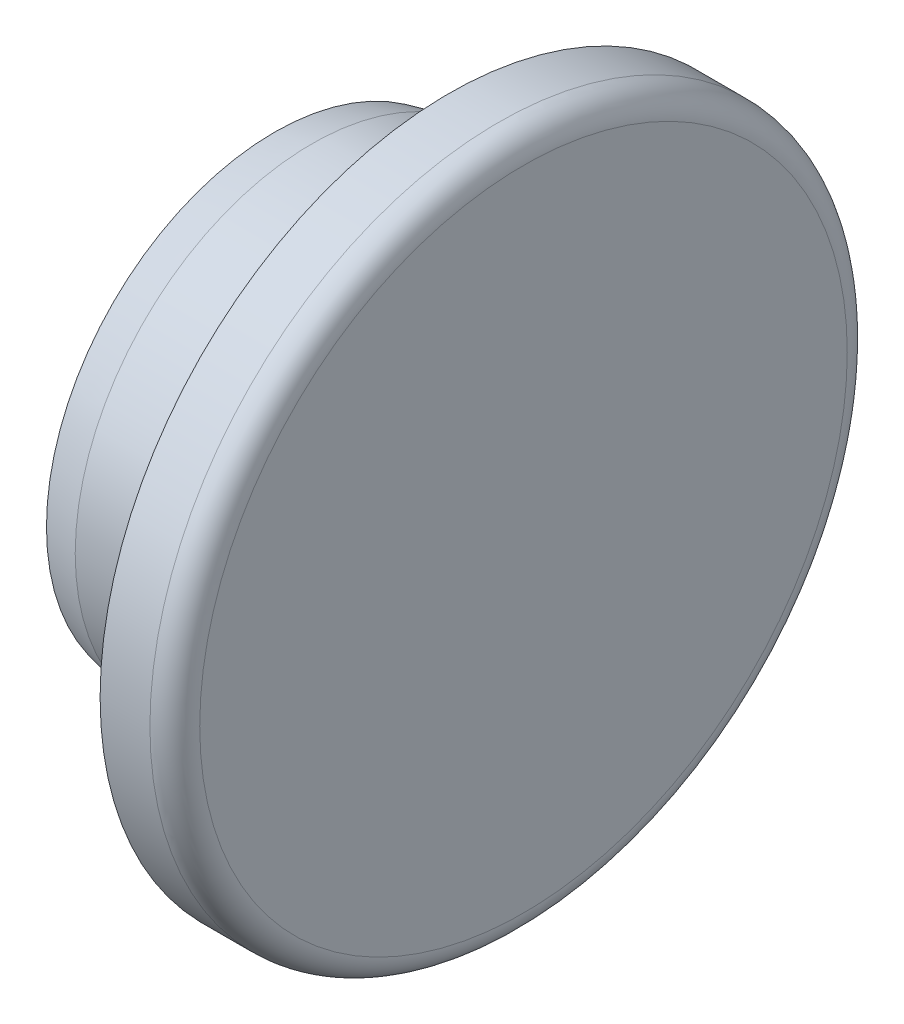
ISO-10303-21;
HEADER;
FILE_DESCRIPTION(('STEP AP214'),'2;1');
FILE_NAME('part.step','',(''),(''),'','','');
FILE_SCHEMA(('AUTOMOTIVE_DESIGN { 1 0 10303 214 1 1 1 1 }'));
ENDSEC;
DATA;
#1=APPLICATION_CONTEXT('core data for automotive mechanical design processes');
#2=APPLICATION_PROTOCOL_DEFINITION('international standard','automotive_design',2000,#1);
#3=PRODUCT_CONTEXT('',#1,'mechanical');
#4=PRODUCT('Part','Part','',(#3));
#5=PRODUCT_RELATED_PRODUCT_CATEGORY('part','',(#4));
#6=PRODUCT_DEFINITION_FORMATION('','',#4);
#7=PRODUCT_DEFINITION_CONTEXT('part definition',#1,'design');
#8=PRODUCT_DEFINITION('design','',#6,#7);
#9=PRODUCT_DEFINITION_SHAPE('','',#8);
#10=(LENGTH_UNIT() NAMED_UNIT(*) SI_UNIT(.MILLI.,.METRE.));
#11=(NAMED_UNIT(*) PLANE_ANGLE_UNIT() SI_UNIT($,.RADIAN.));
#12=(NAMED_UNIT(*) SI_UNIT($,.STERADIAN.) SOLID_ANGLE_UNIT());
#13=UNCERTAINTY_MEASURE_WITH_UNIT(LENGTH_MEASURE(1.E-05),#10,'distance_accuracy_value','');
#14=(GEOMETRIC_REPRESENTATION_CONTEXT(3) GLOBAL_UNCERTAINTY_ASSIGNED_CONTEXT((#13)) GLOBAL_UNIT_ASSIGNED_CONTEXT((#10,
#11,#12)) REPRESENTATION_CONTEXT('',''));
#15=CARTESIAN_POINT('',(0.,0.,0.));
#16=DIRECTION('',(0.,0.,1.));
#17=DIRECTION('',(1.,0.,0.));
#18=AXIS2_PLACEMENT_3D('',#15,#16,#17);
#19=CARTESIAN_POINT('',(0.,7.,0.));
#20=DIRECTION('',(1.,0.,0.));
#21=DIRECTION('',(0.,0.,-1.));
#22=AXIS2_PLACEMENT_3D('',#19,#20,#21);
#23=PLANE('',#22);
#24=CARTESIAN_POINT('',(0.,0.,0.));
#25=DIRECTION('',(1.,0.,0.));
#26=DIRECTION('',(0.,0.,-1.));
#27=AXIS2_PLACEMENT_3D('',#24,#25,#26);
#28=CIRCLE('',#27,9.15369771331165);
#29=CARTESIAN_POINT('',(0.,0.,-9.15369771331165));
#30=VERTEX_POINT('',#29);
#31=EDGE_CURVE('E38',#30,#30,#28,.F.);
#32=ORIENTED_EDGE('',*,*,#31,.T.);
#33=EDGE_LOOP('',(#32));
#34=FACE_BOUND('',#33,.T.);
#35=CARTESIAN_POINT('',(0.,0.,0.));
#36=DIRECTION('',(-1.,0.,0.));
#37=DIRECTION('',(0.,0.,1.));
#38=AXIS2_PLACEMENT_3D('',#35,#36,#37);
#39=CIRCLE('',#38,7.);
#40=CARTESIAN_POINT('',(0.,0.,7.));
#41=VERTEX_POINT('',#40);
#42=EDGE_CURVE('E60',#41,#41,#39,.T.);
#43=ORIENTED_EDGE('',*,*,#42,.F.);
#44=EDGE_LOOP('',(#43));
#45=FACE_BOUND('',#44,.T.);
#46=ADVANCED_FACE('F31',(#34,#45),#23,.F.);
#47=CARTESIAN_POINT('',(-7.21543394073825,0.,0.));
#48=DIRECTION('',(-1.,0.,0.));
#49=DIRECTION('',(0.,0.,1.));
#50=AXIS2_PLACEMENT_3D('',#47,#48,#49);
#51=CYLINDRICAL_SURFACE('',#50,9.5);
#52=CARTESIAN_POINT('',(1.50000000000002,0.,0.));
#53=DIRECTION('',(1.,0.,0.));
#54=DIRECTION('',(0.,0.,-1.));
#55=AXIS2_PLACEMENT_3D('',#52,#53,#54);
#56=CIRCLE('',#55,9.5);
#57=CARTESIAN_POINT('',(1.50000000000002,0.,-9.5));
#58=VERTEX_POINT('',#57);
#59=EDGE_CURVE('E10',#58,#58,#56,.T.);
#60=ORIENTED_EDGE('',*,*,#59,.T.);
#61=EDGE_LOOP('',(#60));
#62=FACE_BOUND('',#61,.T.);
#63=CARTESIAN_POINT('',(7.,0.,0.));
#64=DIRECTION('',(-1.,0.,0.));
#65=DIRECTION('',(0.,0.,1.));
#66=AXIS2_PLACEMENT_3D('',#63,#64,#65);
#67=CIRCLE('',#66,9.5);
#68=CARTESIAN_POINT('',(7.,0.,9.5));
#69=VERTEX_POINT('',#68);
#70=EDGE_CURVE('E51',#69,#69,#67,.T.);
#71=ORIENTED_EDGE('',*,*,#70,.T.);
#72=EDGE_LOOP('',(#71));
#73=FACE_BOUND('',#72,.T.);
#74=ADVANCED_FACE('F67',(#62,#73),#51,.T.);
#75=CARTESIAN_POINT('',(7.,9.5,0.));
#76=DIRECTION('',(1.,0.,0.));
#77=DIRECTION('',(0.,0.,-1.));
#78=AXIS2_PLACEMENT_3D('',#75,#76,#77);
#79=PLANE('',#78);
#80=ORIENTED_EDGE('',*,*,#70,.F.);
#81=EDGE_LOOP('',(#80));
#82=FACE_BOUND('',#81,.T.);
#83=CARTESIAN_POINT('',(7.,0.,0.));
#84=DIRECTION('',(-1.,0.,0.));
#85=DIRECTION('',(0.,0.,1.));
#86=AXIS2_PLACEMENT_3D('',#83,#84,#85);
#87=CIRCLE('',#86,14.);
#88=CARTESIAN_POINT('',(7.,0.,14.));
#89=VERTEX_POINT('',#88);
#90=EDGE_CURVE('E54',#89,#89,#87,.T.);
#91=ORIENTED_EDGE('',*,*,#90,.T.);
#92=EDGE_LOOP('',(#91));
#93=FACE_BOUND('',#92,.T.);
#94=ADVANCED_FACE('F72',(#82,#93),#79,.F.);
#95=CARTESIAN_POINT('',(-7.21543394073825,0.,0.));
#96=DIRECTION('',(-1.,0.,0.));
#97=DIRECTION('',(0.,0.,1.));
#98=AXIS2_PLACEMENT_3D('',#95,#96,#97);
#99=CYLINDRICAL_SURFACE('',#98,14.);
#100=CARTESIAN_POINT('',(9.,0.,0.));
#101=DIRECTION('',(-1.,0.,0.));
#102=DIRECTION('',(0.,0.,1.));
#103=AXIS2_PLACEMENT_3D('',#100,#101,#102);
#104=CIRCLE('',#103,14.);
#105=CARTESIAN_POINT('',(9.,0.,14.));
#106=VERTEX_POINT('',#105);
#107=EDGE_CURVE('E46',#106,#106,#104,.T.);
#108=ORIENTED_EDGE('',*,*,#107,.T.);
#109=EDGE_LOOP('',(#108));
#110=FACE_BOUND('',#109,.T.);
#111=ORIENTED_EDGE('',*,*,#90,.F.);
#112=EDGE_LOOP('',(#111));
#113=FACE_BOUND('',#112,.T.);
#114=ADVANCED_FACE('F90',(#110,#113),#99,.T.);
#115=CARTESIAN_POINT('',(10.,0.,0.));
#116=DIRECTION('',(-1.,0.,0.));
#117=DIRECTION('',(0.,0.,1.));
#118=AXIS2_PLACEMENT_3D('',#115,#116,#117);
#119=PLANE('',#118);
#120=CARTESIAN_POINT('',(10.,0.,0.));
#121=DIRECTION('',(-1.,0.,0.));
#122=DIRECTION('',(0.,0.,1.));
#123=AXIS2_PLACEMENT_3D('',#120,#121,#122);
#124=CIRCLE('',#123,13.);
#125=CARTESIAN_POINT('',(10.,0.,13.));
#126=VERTEX_POINT('',#125);
#127=EDGE_CURVE('E42',#126,#126,#124,.F.);
#128=ORIENTED_EDGE('',*,*,#127,.T.);
#129=EDGE_LOOP('',(#128));
#130=FACE_BOUND('',#129,.T.);
#131=ADVANCED_FACE('F93',(#130),#119,.F.);
#132=CARTESIAN_POINT('',(7.,7.,0.));
#133=DIRECTION('',(1.,0.,0.));
#134=DIRECTION('',(0.,0.,-1.));
#135=AXIS2_PLACEMENT_3D('',#132,#133,#134);
#136=PLANE('',#135);
#137=CARTESIAN_POINT('',(7.,0.,0.));
#138=DIRECTION('',(-1.,0.,0.));
#139=DIRECTION('',(0.,0.,1.));
#140=AXIS2_PLACEMENT_3D('',#137,#138,#139);
#141=CIRCLE('',#140,7.);
#142=CARTESIAN_POINT('',(7.,0.,7.));
#143=VERTEX_POINT('',#142);
#144=EDGE_CURVE('E57',#143,#143,#141,.T.);
#145=ORIENTED_EDGE('',*,*,#144,.T.);
#146=EDGE_LOOP('',(#145));
#147=FACE_BOUND('',#146,.T.);
#148=ADVANCED_FACE('F83',(#147),#136,.F.);
#149=CARTESIAN_POINT('',(-7.21543394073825,0.,0.));
#150=DIRECTION('',(-1.,0.,0.));
#151=DIRECTION('',(0.,0.,1.));
#152=AXIS2_PLACEMENT_3D('',#149,#150,#151);
#153=CYLINDRICAL_SURFACE('',#152,7.);
#154=ORIENTED_EDGE('',*,*,#144,.F.);
#155=EDGE_LOOP('',(#154));
#156=FACE_BOUND('',#155,.T.);
#157=ORIENTED_EDGE('',*,*,#42,.T.);
#158=EDGE_LOOP('',(#157));
#159=FACE_BOUND('',#158,.T.);
#160=ADVANCED_FACE('F64',(#156,#159),#153,.F.);
#161=CARTESIAN_POINT('',(9.,0.,0.));
#162=DIRECTION('',(-1.,0.,0.));
#163=DIRECTION('',(0.,0.,1.));
#164=AXIS2_PLACEMENT_3D('',#161,#162,#163);
#165=TOROIDAL_SURFACE('',#164,13.,1.);
#166=ORIENTED_EDGE('',*,*,#127,.F.);
#167=EDGE_LOOP('',(#166));
#168=FACE_BOUND('',#167,.T.);
#169=ORIENTED_EDGE('',*,*,#107,.F.);
#170=EDGE_LOOP('',(#169));
#171=FACE_BOUND('',#170,.T.);
#172=ADVANCED_FACE('F75',(#168,#171),#165,.T.);
#173=CARTESIAN_POINT('',(0.,0.,0.));
#174=DIRECTION('',(1.,0.,0.));
#175=DIRECTION('',(0.,0.,-1.));
#176=AXIS2_PLACEMENT_3D('',#173,#174,#175);
#177=CONICAL_SURFACE('',#176,9.15369771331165,0.226892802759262);
#178=ORIENTED_EDGE('',*,*,#59,.F.);
#179=EDGE_LOOP('',(#178));
#180=FACE_BOUND('',#179,.T.);
#181=ORIENTED_EDGE('',*,*,#31,.F.);
#182=EDGE_LOOP('',(#181));
#183=FACE_BOUND('',#182,.T.);
#184=ADVANCED_FACE('F33',(#180,#183),#177,.T.);
#185=CLOSED_SHELL('',(#46,#74,#94,#114,#131,#148,#160,#172,#184));
#186=MANIFOLD_SOLID_BREP('B2',#185);
#187=ADVANCED_BREP_SHAPE_REPRESENTATION('',(#18,#186),#14);
#188=SHAPE_DEFINITION_REPRESENTATION(#9,#187);
ENDSEC;
END-ISO-10303-21;
